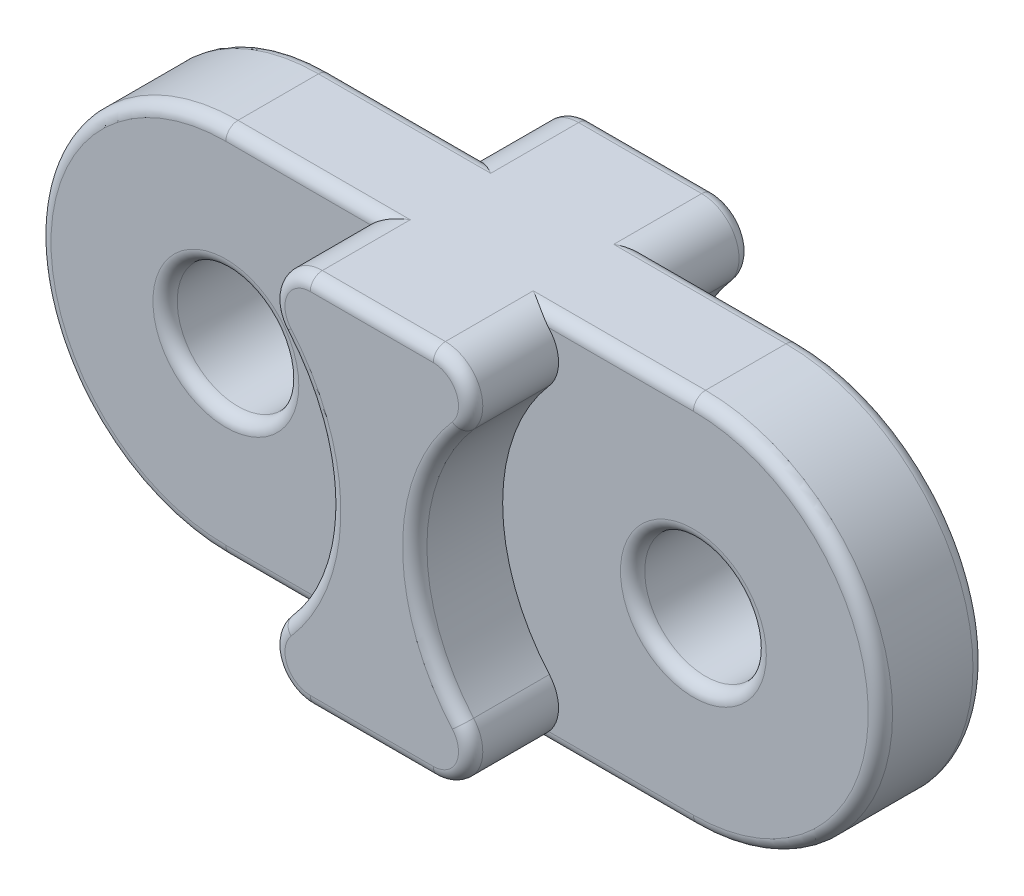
from build123d import *

# Parameters (mm, degrees)
EXTRUDE1_DEPTH     = 9.525
SKETCH2_R          = 12.954
CUT_EXTRUDE1_DEPTH = 5.969
SKETCH3_R          = 4.1275
CUT_EXTRUDE2_DEPTH = 49.043782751
FILLET1_R          = 2.54
FILLET2_R          = 0.8255


with BuildPart() as part:
    # Sketch1 → Extrude1 (new, symmetric)
    with BuildSketch(Plane.XY):
        with BuildLine():
            Line((-31.75, 12.7), (0, 12.7))
            ThreePointArc((0, 12.7), (12.7, 0), (0, -12.7))
            Line((0, -12.7), (-31.75, -12.7))
            ThreePointArc((-31.75, -12.7), (-44.45, 0), (-31.75, 12.7))
        make_face()
    extrude(amount=EXTRUDE1_DEPTH, both=True)

    # Sketch2 → Cut-Extrude1 (cut)
    with BuildSketch(Plane.XY.offset(9.525)):
        Circle(SKETCH2_R)
        with Locations((-31.75, 0)):
            Circle(SKETCH2_R)
    cut_extrude1 = extrude(amount=-CUT_EXTRUDE1_DEPTH, mode=Mode.SUBTRACT)

    # Mirror1: Cut-Extrude1 across plane
    add(cut_extrude1.mirror(Plane.XY), mode=Mode.SUBTRACT)

    # Sketch3 → Cut-Extrude2 (cut, through all)
    with BuildSketch(Plane.XY.offset(3.556)):
        with Locations((-31.75, 0)):
            Circle(SKETCH3_R)
        Circle(SKETCH3_R)
    extrude(amount=-CUT_EXTRUDE2_DEPTH, mode=Mode.SUBTRACT)

    # Fillet1
    fillet1_edges = [part.edges().sort_by_distance(p)[0] for p in [
        (-2.552668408, 12.7, 6.5405),
        (-2.552668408, -12.7, 6.5405),
        (-29.197331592, 12.7, 6.5405),
        (-29.197331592, -12.7, 6.5405),
        (-2.552668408, 12.7, -6.5405),
        (-2.552668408, -12.7, -6.5405),
        (-29.197331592, 12.7, -6.5405),
        (-29.197331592, -12.7, -6.5405),
    ]]
    fillet(fillet1_edges, radius=FILLET1_R)

    # Fillet2
    fillet2_edges = [part.edges().sort_by_distance(p)[0] for p in [
        (-15.875, 12.7, 9.525),
        (-25.901101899, 12.7, 3.556),
        (-25.901101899, 12.7, -3.556),
        (-15.875, 12.7, -9.525),
        (-5.848898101, 12.7, -3.556),
        (-5.848898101, 12.7, 3.556),
        (-9.386718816, 11.21381275, 9.525),
        (-12.954, 0, 9.525),
        (-9.386718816, -11.21381275, 9.525),
        (-15.875, -12.7, 9.525),
        (-5.848898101, -12.7, 3.556),
        (-5.848898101, -12.7, -3.556),
        (-15.875, -12.7, -9.525),
        (-25.901101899, -12.7, -3.556),
        (-25.901101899, -12.7, 3.556),
        (-22.363281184, -11.21381275, 9.525),
        (-18.796, 0, 9.525),
        (-22.363281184, -11.21381275, -9.525),
        (-18.796, 0, -9.525),
        (-9.386718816, -11.21381275, -9.525),
        (-12.954, 0, -9.525),
        (12.7, 0, 3.556),
        (-4.1275, 0, 3.556),
        (-4.1275, 0, -3.556),
        (12.7, 0, -3.556),
        (-9.386718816, 11.21381275, -9.525),
        (-22.363281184, 11.21381275, -9.525),
        (-44.45, 0, -3.556),
        (-35.8775, 0, -3.556),
        (-35.8775, 0, 3.556),
        (-44.45, 0, 3.556),
        (-22.363281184, 11.21381275, 9.525),
    ]]
    fillet(fillet2_edges, radius=FILLET2_R)


solid = part.part
